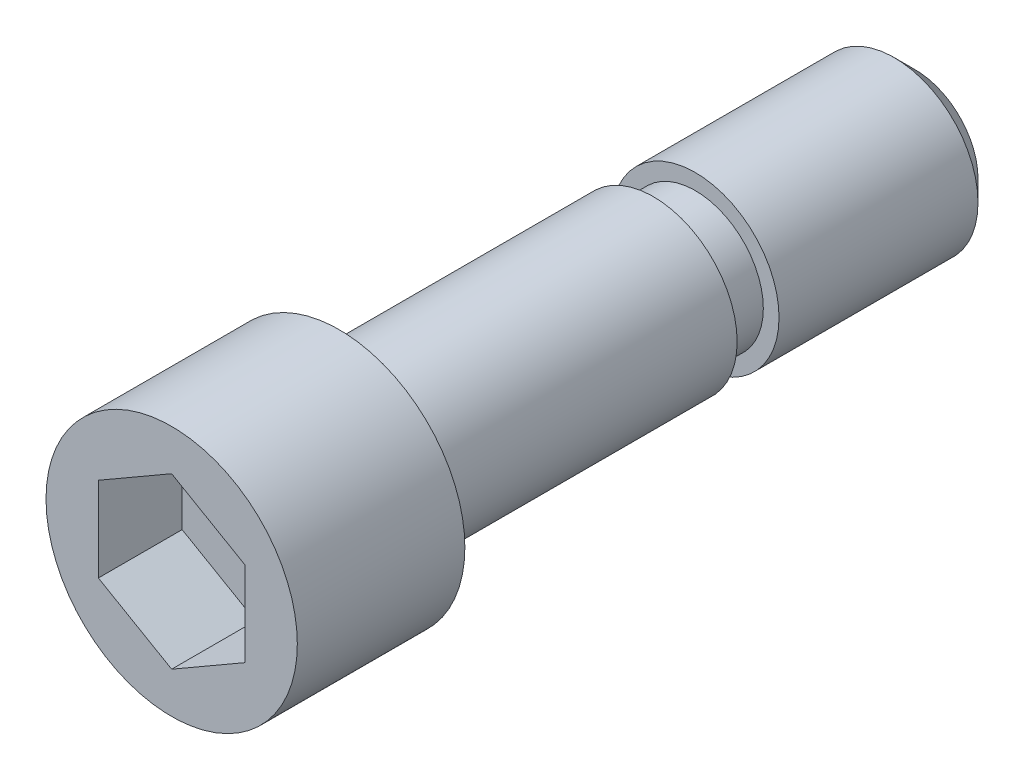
ISO-10303-21;
HEADER;
FILE_DESCRIPTION(('STEP AP214'),'2;1');
FILE_NAME('part.step','',(''),(''),'','','');
FILE_SCHEMA(('AUTOMOTIVE_DESIGN { 1 0 10303 214 1 1 1 1 }'));
ENDSEC;
DATA;
#1=APPLICATION_CONTEXT('core data for automotive mechanical design processes');
#2=APPLICATION_PROTOCOL_DEFINITION('international standard','automotive_design',2000,#1);
#3=PRODUCT_CONTEXT('',#1,'mechanical');
#4=PRODUCT('Part','Part','',(#3));
#5=PRODUCT_RELATED_PRODUCT_CATEGORY('part','',(#4));
#6=PRODUCT_DEFINITION_FORMATION('','',#4);
#7=PRODUCT_DEFINITION_CONTEXT('part definition',#1,'design');
#8=PRODUCT_DEFINITION('design','',#6,#7);
#9=PRODUCT_DEFINITION_SHAPE('','',#8);
#10=(LENGTH_UNIT() NAMED_UNIT(*) SI_UNIT(.MILLI.,.METRE.));
#11=(NAMED_UNIT(*) PLANE_ANGLE_UNIT() SI_UNIT($,.RADIAN.));
#12=(NAMED_UNIT(*) SI_UNIT($,.STERADIAN.) SOLID_ANGLE_UNIT());
#13=UNCERTAINTY_MEASURE_WITH_UNIT(LENGTH_MEASURE(1.E-05),#10,'distance_accuracy_value','');
#14=(GEOMETRIC_REPRESENTATION_CONTEXT(3) GLOBAL_UNCERTAINTY_ASSIGNED_CONTEXT((#13)) GLOBAL_UNIT_ASSIGNED_CONTEXT((#10,
#11,#12)) REPRESENTATION_CONTEXT('',''));
#15=CARTESIAN_POINT('',(0.,0.,0.));
#16=DIRECTION('',(0.,0.,1.));
#17=DIRECTION('',(1.,0.,0.));
#18=AXIS2_PLACEMENT_3D('',#15,#16,#17);
#19=CARTESIAN_POINT('',(-12.,0.,16.));
#20=DIRECTION('',(0.,0.,-1.));
#21=DIRECTION('',(-1.,0.,0.));
#22=AXIS2_PLACEMENT_3D('',#19,#20,#21);
#23=PLANE('',#22);
#24=DIRECTION('',(-0.866025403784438,-0.5,0.));
#25=VECTOR('',#24,1.);
#26=CARTESIAN_POINT('',(0.,8.08290376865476,16.));
#27=LINE('',#26,#25);
#28=CARTESIAN_POINT('',(0.,8.08290376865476,16.));
#29=VERTEX_POINT('',#28);
#30=CARTESIAN_POINT('',(-7.,4.04145188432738,16.));
#31=VERTEX_POINT('',#30);
#32=EDGE_CURVE('E82',#29,#31,#27,.T.);
#33=ORIENTED_EDGE('',*,*,#32,.F.);
#34=DIRECTION('',(-0.866025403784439,0.5,0.));
#35=VECTOR('',#34,1.);
#36=CARTESIAN_POINT('',(7.,4.04145188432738,16.));
#37=LINE('',#36,#35);
#38=CARTESIAN_POINT('',(7.,4.04145188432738,16.));
#39=VERTEX_POINT('',#38);
#40=EDGE_CURVE('E28',#39,#29,#37,.T.);
#41=ORIENTED_EDGE('',*,*,#40,.F.);
#42=DIRECTION('',(0.,1.,0.));
#43=VECTOR('',#42,1.);
#44=CARTESIAN_POINT('',(7.,-4.04145188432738,16.));
#45=LINE('',#44,#43);
#46=CARTESIAN_POINT('',(7.,-4.04145188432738,16.));
#47=VERTEX_POINT('',#46);
#48=EDGE_CURVE('E97',#47,#39,#45,.T.);
#49=ORIENTED_EDGE('',*,*,#48,.F.);
#50=DIRECTION('',(0.866025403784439,0.5,0.));
#51=VECTOR('',#50,1.);
#52=CARTESIAN_POINT('',(0.,-8.08290376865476,16.));
#53=LINE('',#52,#51);
#54=CARTESIAN_POINT('',(0.,-8.08290376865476,16.));
#55=VERTEX_POINT('',#54);
#56=EDGE_CURVE('E91',#55,#47,#53,.T.);
#57=ORIENTED_EDGE('',*,*,#56,.F.);
#58=DIRECTION('',(0.866025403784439,-0.5,0.));
#59=VECTOR('',#58,1.);
#60=CARTESIAN_POINT('',(-7.,-4.04145188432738,16.));
#61=LINE('',#60,#59);
#62=CARTESIAN_POINT('',(-7.,-4.04145188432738,16.));
#63=VERTEX_POINT('',#62);
#64=EDGE_CURVE('E89',#63,#55,#61,.T.);
#65=ORIENTED_EDGE('',*,*,#64,.F.);
#66=DIRECTION('',(0.,-1.,0.));
#67=VECTOR('',#66,1.);
#68=CARTESIAN_POINT('',(-7.,4.04145188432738,16.));
#69=LINE('',#68,#67);
#70=EDGE_CURVE('E71',#31,#63,#69,.T.);
#71=ORIENTED_EDGE('',*,*,#70,.F.);
#72=EDGE_LOOP('',(#33,#41,#49,#57,#65,#71));
#73=FACE_BOUND('',#72,.T.);
#74=CARTESIAN_POINT('',(0.,0.,16.));
#75=DIRECTION('',(0.,0.,1.));
#76=DIRECTION('',(1.,0.,0.));
#77=AXIS2_PLACEMENT_3D('',#74,#75,#76);
#78=CIRCLE('',#77,12.);
#79=CARTESIAN_POINT('',(12.,0.,16.));
#80=VERTEX_POINT('',#79);
#81=EDGE_CURVE('E9',#80,#80,#78,.T.);
#82=ORIENTED_EDGE('',*,*,#81,.T.);
#83=EDGE_LOOP('',(#82));
#84=FACE_BOUND('',#83,.T.);
#85=ADVANCED_FACE('F14',(#73,#84),#23,.F.);
#86=CARTESIAN_POINT('',(0.,0.,25.));
#87=DIRECTION('',(0.,0.,1.));
#88=DIRECTION('',(1.,0.,0.));
#89=AXIS2_PLACEMENT_3D('',#86,#87,#88);
#90=CYLINDRICAL_SURFACE('',#89,12.);
#91=ORIENTED_EDGE('',*,*,#81,.F.);
#92=EDGE_LOOP('',(#91));
#93=FACE_BOUND('',#92,.T.);
#94=CARTESIAN_POINT('',(0.,0.,0.));
#95=DIRECTION('',(0.,0.,1.));
#96=DIRECTION('',(1.,0.,0.));
#97=AXIS2_PLACEMENT_3D('',#94,#95,#96);
#98=CIRCLE('',#97,12.);
#99=CARTESIAN_POINT('',(12.,0.,0.));
#100=VERTEX_POINT('',#99);
#101=EDGE_CURVE('E21',#100,#100,#98,.T.);
#102=ORIENTED_EDGE('',*,*,#101,.T.);
#103=EDGE_LOOP('',(#102));
#104=FACE_BOUND('',#103,.T.);
#105=ADVANCED_FACE('F144',(#93,#104),#90,.T.);
#106=CARTESIAN_POINT('',(-8.,0.,0.));
#107=DIRECTION('',(0.,0.,1.));
#108=DIRECTION('',(1.,0.,0.));
#109=AXIS2_PLACEMENT_3D('',#106,#107,#108);
#110=PLANE('',#109);
#111=ORIENTED_EDGE('',*,*,#101,.F.);
#112=EDGE_LOOP('',(#111));
#113=FACE_BOUND('',#112,.T.);
#114=CARTESIAN_POINT('',(0.,0.,0.));
#115=DIRECTION('',(0.,0.,1.));
#116=DIRECTION('',(1.,0.,0.));
#117=AXIS2_PLACEMENT_3D('',#114,#115,#116);
#118=CIRCLE('',#117,8.);
#119=CARTESIAN_POINT('',(8.,0.,0.));
#120=VERTEX_POINT('',#119);
#121=EDGE_CURVE('E139',#120,#120,#118,.T.);
#122=ORIENTED_EDGE('',*,*,#121,.T.);
#123=EDGE_LOOP('',(#122));
#124=FACE_BOUND('',#123,.T.);
#125=ADVANCED_FACE('F146',(#113,#124),#110,.F.);
#126=CARTESIAN_POINT('',(0.,0.,25.));
#127=DIRECTION('',(0.,0.,1.));
#128=DIRECTION('',(1.,0.,0.));
#129=AXIS2_PLACEMENT_3D('',#126,#127,#128);
#130=CYLINDRICAL_SURFACE('',#129,8.);
#131=ORIENTED_EDGE('',*,*,#121,.F.);
#132=EDGE_LOOP('',(#131));
#133=FACE_BOUND('',#132,.T.);
#134=CARTESIAN_POINT('',(0.,0.,-30.));
#135=DIRECTION('',(0.,0.,1.));
#136=DIRECTION('',(1.,0.,0.));
#137=AXIS2_PLACEMENT_3D('',#134,#135,#136);
#138=CIRCLE('',#137,8.);
#139=CARTESIAN_POINT('',(8.,0.,-30.));
#140=VERTEX_POINT('',#139);
#141=EDGE_CURVE('E136',#140,#140,#138,.T.);
#142=ORIENTED_EDGE('',*,*,#141,.T.);
#143=EDGE_LOOP('',(#142));
#144=FACE_BOUND('',#143,.T.);
#145=ADVANCED_FACE('F149',(#133,#144),#130,.T.);
#146=CARTESIAN_POINT('',(-6.5,0.,-30.));
#147=DIRECTION('',(0.,0.,1.));
#148=DIRECTION('',(1.,0.,0.));
#149=AXIS2_PLACEMENT_3D('',#146,#147,#148);
#150=PLANE('',#149);
#151=ORIENTED_EDGE('',*,*,#141,.F.);
#152=EDGE_LOOP('',(#151));
#153=FACE_BOUND('',#152,.T.);
#154=CARTESIAN_POINT('',(0.,0.,-30.));
#155=DIRECTION('',(0.,0.,1.));
#156=DIRECTION('',(1.,0.,0.));
#157=AXIS2_PLACEMENT_3D('',#154,#155,#156);
#158=CIRCLE('',#157,6.5);
#159=CARTESIAN_POINT('',(6.5,0.,-30.));
#160=VERTEX_POINT('',#159);
#161=EDGE_CURVE('E133',#160,#160,#158,.T.);
#162=ORIENTED_EDGE('',*,*,#161,.T.);
#163=EDGE_LOOP('',(#162));
#164=FACE_BOUND('',#163,.T.);
#165=ADVANCED_FACE('F155',(#153,#164),#150,.F.);
#166=CARTESIAN_POINT('',(0.,0.,25.));
#167=DIRECTION('',(0.,0.,1.));
#168=DIRECTION('',(1.,0.,0.));
#169=AXIS2_PLACEMENT_3D('',#166,#167,#168);
#170=CYLINDRICAL_SURFACE('',#169,6.5);
#171=ORIENTED_EDGE('',*,*,#161,.F.);
#172=EDGE_LOOP('',(#171));
#173=FACE_BOUND('',#172,.T.);
#174=CARTESIAN_POINT('',(0.,0.,-34.));
#175=DIRECTION('',(0.,0.,1.));
#176=DIRECTION('',(1.,0.,0.));
#177=AXIS2_PLACEMENT_3D('',#174,#175,#176);
#178=CIRCLE('',#177,6.5);
#179=CARTESIAN_POINT('',(6.5,0.,-34.));
#180=VERTEX_POINT('',#179);
#181=EDGE_CURVE('E130',#180,#180,#178,.T.);
#182=ORIENTED_EDGE('',*,*,#181,.T.);
#183=EDGE_LOOP('',(#182));
#184=FACE_BOUND('',#183,.T.);
#185=ADVANCED_FACE('F161',(#173,#184),#170,.T.);
#186=CARTESIAN_POINT('',(-8.,0.,-34.));
#187=DIRECTION('',(0.,0.,-1.));
#188=DIRECTION('',(-1.,0.,0.));
#189=AXIS2_PLACEMENT_3D('',#186,#187,#188);
#190=PLANE('',#189);
#191=ORIENTED_EDGE('',*,*,#181,.F.);
#192=EDGE_LOOP('',(#191));
#193=FACE_BOUND('',#192,.T.);
#194=CARTESIAN_POINT('',(0.,0.,-34.));
#195=DIRECTION('',(0.,0.,1.));
#196=DIRECTION('',(1.,0.,0.));
#197=AXIS2_PLACEMENT_3D('',#194,#195,#196);
#198=CIRCLE('',#197,8.);
#199=CARTESIAN_POINT('',(8.,0.,-34.));
#200=VERTEX_POINT('',#199);
#201=EDGE_CURVE('E127',#200,#200,#198,.T.);
#202=ORIENTED_EDGE('',*,*,#201,.T.);
#203=EDGE_LOOP('',(#202));
#204=FACE_BOUND('',#203,.T.);
#205=ADVANCED_FACE('F167',(#193,#204),#190,.F.);
#206=CARTESIAN_POINT('',(0.,0.,25.));
#207=DIRECTION('',(0.,0.,1.));
#208=DIRECTION('',(1.,0.,0.));
#209=AXIS2_PLACEMENT_3D('',#206,#207,#208);
#210=CYLINDRICAL_SURFACE('',#209,8.);
#211=ORIENTED_EDGE('',*,*,#201,.F.);
#212=EDGE_LOOP('',(#211));
#213=FACE_BOUND('',#212,.T.);
#214=CARTESIAN_POINT('',(0.,0.,-53.));
#215=DIRECTION('',(0.,0.,1.));
#216=DIRECTION('',(1.,0.,0.));
#217=AXIS2_PLACEMENT_3D('',#214,#215,#216);
#218=CIRCLE('',#217,8.);
#219=CARTESIAN_POINT('',(8.,0.,-53.));
#220=VERTEX_POINT('',#219);
#221=EDGE_CURVE('E124',#220,#220,#218,.T.);
#222=ORIENTED_EDGE('',*,*,#221,.T.);
#223=EDGE_LOOP('',(#222));
#224=FACE_BOUND('',#223,.T.);
#225=ADVANCED_FACE('F173',(#213,#224),#210,.T.);
#226=CARTESIAN_POINT('',(0.,0.,-55.));
#227=DIRECTION('',(0.,0.,1.));
#228=DIRECTION('',(1.,0.,0.));
#229=AXIS2_PLACEMENT_3D('',#226,#227,#228);
#230=CONICAL_SURFACE('',#229,6.,0.785398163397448);
#231=ORIENTED_EDGE('',*,*,#221,.F.);
#232=EDGE_LOOP('',(#231));
#233=FACE_BOUND('',#232,.T.);
#234=CARTESIAN_POINT('',(0.,0.,-55.));
#235=DIRECTION('',(0.,0.,1.));
#236=DIRECTION('',(1.,0.,0.));
#237=AXIS2_PLACEMENT_3D('',#234,#235,#236);
#238=CIRCLE('',#237,6.);
#239=CARTESIAN_POINT('',(6.,0.,-55.));
#240=VERTEX_POINT('',#239);
#241=EDGE_CURVE('E115',#240,#240,#238,.T.);
#242=ORIENTED_EDGE('',*,*,#241,.T.);
#243=EDGE_LOOP('',(#242));
#244=FACE_BOUND('',#243,.T.);
#245=ADVANCED_FACE('F179',(#233,#244),#230,.T.);
#246=CARTESIAN_POINT('',(0.,0.,-55.));
#247=DIRECTION('',(0.,0.,1.));
#248=DIRECTION('',(1.,0.,0.));
#249=AXIS2_PLACEMENT_3D('',#246,#247,#248);
#250=PLANE('',#249);
#251=ORIENTED_EDGE('',*,*,#241,.F.);
#252=EDGE_LOOP('',(#251));
#253=FACE_BOUND('',#252,.T.);
#254=ADVANCED_FACE('F185',(#253),#250,.F.);
#255=CARTESIAN_POINT('',(7.,4.04145188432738,8.));
#256=DIRECTION('',(0.5,0.866025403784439,0.));
#257=DIRECTION('',(-0.866025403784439,0.5,0.));
#258=AXIS2_PLACEMENT_3D('',#255,#256,#257);
#259=PLANE('',#258);
#260=ORIENTED_EDGE('',*,*,#40,.T.);
#261=DIRECTION('',(0.,0.,1.));
#262=VECTOR('',#261,1.);
#263=CARTESIAN_POINT('',(0.,8.08290376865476,8.));
#264=LINE('',#263,#262);
#265=CARTESIAN_POINT('',(0.,8.08290376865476,8.));
#266=VERTEX_POINT('',#265);
#267=EDGE_CURVE('E79',#266,#29,#264,.T.);
#268=ORIENTED_EDGE('',*,*,#267,.F.);
#269=DIRECTION('',(-0.866025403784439,0.5,0.));
#270=VECTOR('',#269,1.);
#271=CARTESIAN_POINT('',(7.,4.04145188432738,8.));
#272=LINE('',#271,#270);
#273=CARTESIAN_POINT('',(7.,4.04145188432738,8.));
#274=VERTEX_POINT('',#273);
#275=EDGE_CURVE('E99',#274,#266,#272,.T.);
#276=ORIENTED_EDGE('',*,*,#275,.F.);
#277=DIRECTION('',(0.,0.,1.));
#278=VECTOR('',#277,1.);
#279=CARTESIAN_POINT('',(7.,4.04145188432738,8.));
#280=LINE('',#279,#278);
#281=EDGE_CURVE('E35',#274,#39,#280,.T.);
#282=ORIENTED_EDGE('',*,*,#281,.T.);
#283=EDGE_LOOP('',(#260,#268,#276,#282));
#284=FACE_BOUND('',#283,.T.);
#285=ADVANCED_FACE('F190',(#284),#259,.F.);
#286=CARTESIAN_POINT('',(7.,-4.04145188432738,8.));
#287=DIRECTION('',(1.,0.,0.));
#288=DIRECTION('',(0.,1.,0.));
#289=AXIS2_PLACEMENT_3D('',#286,#287,#288);
#290=PLANE('',#289);
#291=ORIENTED_EDGE('',*,*,#48,.T.);
#292=ORIENTED_EDGE('',*,*,#281,.F.);
#293=DIRECTION('',(0.,1.,0.));
#294=VECTOR('',#293,1.);
#295=CARTESIAN_POINT('',(7.,-4.04145188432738,8.));
#296=LINE('',#295,#294);
#297=CARTESIAN_POINT('',(7.,-4.04145188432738,8.));
#298=VERTEX_POINT('',#297);
#299=EDGE_CURVE('E111',#298,#274,#296,.T.);
#300=ORIENTED_EDGE('',*,*,#299,.F.);
#301=DIRECTION('',(0.,0.,1.));
#302=VECTOR('',#301,1.);
#303=CARTESIAN_POINT('',(7.,-4.04145188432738,8.));
#304=LINE('',#303,#302);
#305=EDGE_CURVE('E116',#298,#47,#304,.T.);
#306=ORIENTED_EDGE('',*,*,#305,.T.);
#307=EDGE_LOOP('',(#291,#292,#300,#306));
#308=FACE_BOUND('',#307,.T.);
#309=ADVANCED_FACE('F196',(#308),#290,.F.);
#310=CARTESIAN_POINT('',(0.,-8.08290376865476,8.));
#311=DIRECTION('',(0.5,-0.866025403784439,0.));
#312=DIRECTION('',(0.866025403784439,0.5,0.));
#313=AXIS2_PLACEMENT_3D('',#310,#311,#312);
#314=PLANE('',#313);
#315=ORIENTED_EDGE('',*,*,#56,.T.);
#316=ORIENTED_EDGE('',*,*,#305,.F.);
#317=DIRECTION('',(0.866025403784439,0.5,0.));
#318=VECTOR('',#317,1.);
#319=CARTESIAN_POINT('',(0.,-8.08290376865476,8.));
#320=LINE('',#319,#318);
#321=CARTESIAN_POINT('',(0.,-8.08290376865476,8.));
#322=VERTEX_POINT('',#321);
#323=EDGE_CURVE('E108',#322,#298,#320,.T.);
#324=ORIENTED_EDGE('',*,*,#323,.F.);
#325=DIRECTION('',(0.,0.,1.));
#326=VECTOR('',#325,1.);
#327=CARTESIAN_POINT('',(0.,-8.08290376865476,8.));
#328=LINE('',#327,#326);
#329=EDGE_CURVE('E118',#322,#55,#328,.T.);
#330=ORIENTED_EDGE('',*,*,#329,.T.);
#331=EDGE_LOOP('',(#315,#316,#324,#330));
#332=FACE_BOUND('',#331,.T.);
#333=ADVANCED_FACE('F267',(#332),#314,.F.);
#334=CARTESIAN_POINT('',(-7.,-4.04145188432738,8.));
#335=DIRECTION('',(-0.5,-0.866025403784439,0.));
#336=DIRECTION('',(0.866025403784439,-0.5,0.));
#337=AXIS2_PLACEMENT_3D('',#334,#335,#336);
#338=PLANE('',#337);
#339=ORIENTED_EDGE('',*,*,#64,.T.);
#340=ORIENTED_EDGE('',*,*,#329,.F.);
#341=DIRECTION('',(0.866025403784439,-0.5,0.));
#342=VECTOR('',#341,1.);
#343=CARTESIAN_POINT('',(-7.,-4.04145188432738,8.));
#344=LINE('',#343,#342);
#345=CARTESIAN_POINT('',(-7.,-4.04145188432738,8.));
#346=VERTEX_POINT('',#345);
#347=EDGE_CURVE('E105',#346,#322,#344,.T.);
#348=ORIENTED_EDGE('',*,*,#347,.F.);
#349=DIRECTION('',(0.,0.,1.));
#350=VECTOR('',#349,1.);
#351=CARTESIAN_POINT('',(-7.,-4.04145188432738,8.));
#352=LINE('',#351,#350);
#353=EDGE_CURVE('E78',#346,#63,#352,.T.);
#354=ORIENTED_EDGE('',*,*,#353,.T.);
#355=EDGE_LOOP('',(#339,#340,#348,#354));
#356=FACE_BOUND('',#355,.T.);
#357=ADVANCED_FACE('F276',(#356),#338,.F.);
#358=CARTESIAN_POINT('',(-7.,4.04145188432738,8.));
#359=DIRECTION('',(-1.,0.,0.));
#360=DIRECTION('',(0.,-1.,0.));
#361=AXIS2_PLACEMENT_3D('',#358,#359,#360);
#362=PLANE('',#361);
#363=ORIENTED_EDGE('',*,*,#70,.T.);
#364=ORIENTED_EDGE('',*,*,#353,.F.);
#365=DIRECTION('',(0.,-1.,0.));
#366=VECTOR('',#365,1.);
#367=CARTESIAN_POINT('',(-7.,4.04145188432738,8.));
#368=LINE('',#367,#366);
#369=CARTESIAN_POINT('',(-7.,4.04145188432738,8.));
#370=VERTEX_POINT('',#369);
#371=EDGE_CURVE('E74',#370,#346,#368,.T.);
#372=ORIENTED_EDGE('',*,*,#371,.F.);
#373=DIRECTION('',(0.,0.,1.));
#374=VECTOR('',#373,1.);
#375=CARTESIAN_POINT('',(-7.,4.04145188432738,8.));
#376=LINE('',#375,#374);
#377=EDGE_CURVE('E67',#370,#31,#376,.T.);
#378=ORIENTED_EDGE('',*,*,#377,.T.);
#379=EDGE_LOOP('',(#363,#364,#372,#378));
#380=FACE_BOUND('',#379,.T.);
#381=ADVANCED_FACE('F69',(#380),#362,.F.);
#382=CARTESIAN_POINT('',(0.,8.08290376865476,8.));
#383=DIRECTION('',(-0.5,0.866025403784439,0.));
#384=DIRECTION('',(-0.866025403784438,-0.5,0.));
#385=AXIS2_PLACEMENT_3D('',#382,#383,#384);
#386=PLANE('',#385);
#387=ORIENTED_EDGE('',*,*,#32,.T.);
#388=ORIENTED_EDGE('',*,*,#377,.F.);
#389=DIRECTION('',(-0.866025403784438,-0.5,0.));
#390=VECTOR('',#389,1.);
#391=CARTESIAN_POINT('',(0.,8.08290376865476,8.));
#392=LINE('',#391,#390);
#393=EDGE_CURVE('E102',#266,#370,#392,.T.);
#394=ORIENTED_EDGE('',*,*,#393,.F.);
#395=ORIENTED_EDGE('',*,*,#267,.T.);
#396=EDGE_LOOP('',(#387,#388,#394,#395));
#397=FACE_BOUND('',#396,.T.);
#398=ADVANCED_FACE('F83',(#397),#386,.F.);
#399=CARTESIAN_POINT('',(-7.,12.1243556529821,8.));
#400=DIRECTION('',(0.,0.,1.));
#401=DIRECTION('',(1.,0.,0.));
#402=AXIS2_PLACEMENT_3D('',#399,#400,#401);
#403=PLANE('',#402);
#404=ORIENTED_EDGE('',*,*,#275,.T.);
#405=ORIENTED_EDGE('',*,*,#393,.T.);
#406=ORIENTED_EDGE('',*,*,#371,.T.);
#407=ORIENTED_EDGE('',*,*,#347,.T.);
#408=ORIENTED_EDGE('',*,*,#323,.T.);
#409=ORIENTED_EDGE('',*,*,#299,.T.);
#410=EDGE_LOOP('',(#404,#405,#406,#407,#408,#409));
#411=FACE_BOUND('',#410,.T.);
#412=ADVANCED_FACE('F303',(#411),#403,.T.);
#413=CLOSED_SHELL('',(#85,#105,#125,#145,#165,#185,#205,#225,#245,#254,#285,#309,#333,#357,#381,
#398,#412));
#414=MANIFOLD_SOLID_BREP('B1',#413);
#415=ADVANCED_BREP_SHAPE_REPRESENTATION('',(#18,#414),#14);
#416=SHAPE_DEFINITION_REPRESENTATION(#9,#415);
ENDSEC;
END-ISO-10303-21;
